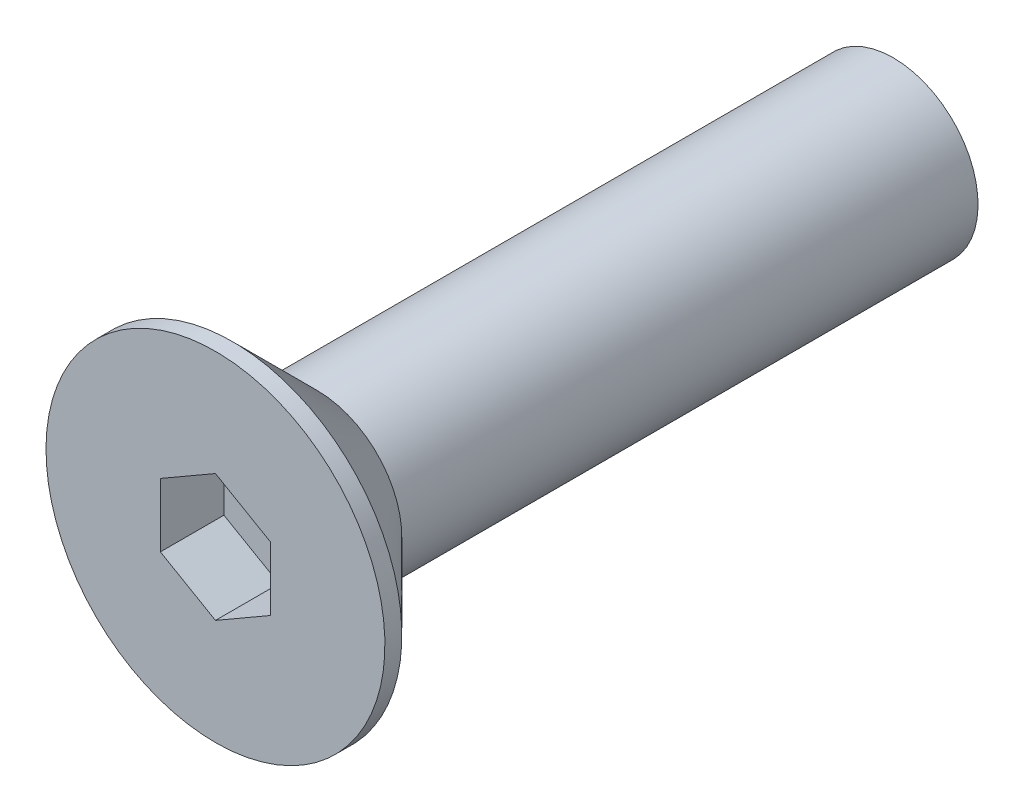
ISO-10303-21;
HEADER;
FILE_DESCRIPTION(('STEP AP214'),'2;1');
FILE_NAME('part.step','',(''),(''),'','','');
FILE_SCHEMA(('AUTOMOTIVE_DESIGN { 1 0 10303 214 1 1 1 1 }'));
ENDSEC;
DATA;
#1=APPLICATION_CONTEXT('core data for automotive mechanical design processes');
#2=APPLICATION_PROTOCOL_DEFINITION('international standard','automotive_design',2000,#1);
#3=PRODUCT_CONTEXT('',#1,'mechanical');
#4=PRODUCT('Part','Part','',(#3));
#5=PRODUCT_RELATED_PRODUCT_CATEGORY('part','',(#4));
#6=PRODUCT_DEFINITION_FORMATION('','',#4);
#7=PRODUCT_DEFINITION_CONTEXT('part definition',#1,'design');
#8=PRODUCT_DEFINITION('design','',#6,#7);
#9=PRODUCT_DEFINITION_SHAPE('','',#8);
#10=(LENGTH_UNIT() NAMED_UNIT(*) SI_UNIT(.MILLI.,.METRE.));
#11=(NAMED_UNIT(*) PLANE_ANGLE_UNIT() SI_UNIT($,.RADIAN.));
#12=(NAMED_UNIT(*) SI_UNIT($,.STERADIAN.) SOLID_ANGLE_UNIT());
#13=UNCERTAINTY_MEASURE_WITH_UNIT(LENGTH_MEASURE(1.E-05),#10,'distance_accuracy_value','');
#14=(GEOMETRIC_REPRESENTATION_CONTEXT(3) GLOBAL_UNCERTAINTY_ASSIGNED_CONTEXT((#13)) GLOBAL_UNIT_ASSIGNED_CONTEXT((#10,
#11,#12)) REPRESENTATION_CONTEXT('',''));
#15=CARTESIAN_POINT('',(0.,0.,0.));
#16=DIRECTION('',(0.,0.,1.));
#17=DIRECTION('',(1.,0.,0.));
#18=AXIS2_PLACEMENT_3D('',#15,#16,#17);
#19=CARTESIAN_POINT('',(1.73205080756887,1.,0.));
#20=DIRECTION('',(0.,0.,-1.));
#21=DIRECTION('',(0.866025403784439,0.5,0.));
#22=AXIS2_PLACEMENT_3D('',#19,#20,#21);
#23=PLANE('',#22);
#24=DIRECTION('',(0.866025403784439,-0.5,0.));
#25=VECTOR('',#24,1.);
#26=CARTESIAN_POINT('',(-0.65,-0.375277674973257,0.));
#27=LINE('',#26,#25);
#28=CARTESIAN_POINT('',(-0.65,-0.375277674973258,0.));
#29=VERTEX_POINT('',#28);
#30=CARTESIAN_POINT('',(0.,-0.750555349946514,0.));
#31=VERTEX_POINT('',#30);
#32=EDGE_CURVE('E102',#29,#31,#27,.T.);
#33=ORIENTED_EDGE('',*,*,#32,.F.);
#34=DIRECTION('',(0.,-1.,0.));
#35=VECTOR('',#34,1.);
#36=CARTESIAN_POINT('',(-0.65,0.375277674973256,0.));
#37=LINE('',#36,#35);
#38=CARTESIAN_POINT('',(-0.65,0.375277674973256,0.));
#39=VERTEX_POINT('',#38);
#40=EDGE_CURVE('E28',#39,#29,#37,.T.);
#41=ORIENTED_EDGE('',*,*,#40,.F.);
#42=DIRECTION('',(-0.866025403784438,-0.5,0.));
#43=VECTOR('',#42,1.);
#44=CARTESIAN_POINT('',(0.,0.750555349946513,0.));
#45=LINE('',#44,#43);
#46=CARTESIAN_POINT('',(0.,0.750555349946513,0.));
#47=VERTEX_POINT('',#46);
#48=EDGE_CURVE('E111',#47,#39,#45,.T.);
#49=ORIENTED_EDGE('',*,*,#48,.F.);
#50=DIRECTION('',(-0.866025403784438,0.5,0.));
#51=VECTOR('',#50,1.);
#52=CARTESIAN_POINT('',(0.65,0.375277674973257,0.));
#53=LINE('',#52,#51);
#54=CARTESIAN_POINT('',(0.65,0.375277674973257,0.));
#55=VERTEX_POINT('',#54);
#56=EDGE_CURVE('E109',#55,#47,#53,.T.);
#57=ORIENTED_EDGE('',*,*,#56,.F.);
#58=DIRECTION('',(0.,1.,0.));
#59=VECTOR('',#58,1.);
#60=CARTESIAN_POINT('',(0.65,-0.375277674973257,0.));
#61=LINE('',#60,#59);
#62=CARTESIAN_POINT('',(0.65,-0.375277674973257,0.));
#63=VERTEX_POINT('',#62);
#64=EDGE_CURVE('E76',#63,#55,#61,.T.);
#65=ORIENTED_EDGE('',*,*,#64,.F.);
#66=DIRECTION('',(0.866025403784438,0.5,0.));
#67=VECTOR('',#66,1.);
#68=CARTESIAN_POINT('',(0.,-0.750555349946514,0.));
#69=LINE('',#68,#67);
#70=EDGE_CURVE('E105',#31,#63,#69,.T.);
#71=ORIENTED_EDGE('',*,*,#70,.F.);
#72=EDGE_LOOP('',(#33,#41,#49,#57,#65,#71));
#73=FACE_BOUND('',#72,.T.);
#74=CARTESIAN_POINT('',(0.,0.,0.));
#75=DIRECTION('',(0.,0.,1.));
#76=DIRECTION('',(-0.866025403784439,-0.5,0.));
#77=AXIS2_PLACEMENT_3D('',#74,#75,#76);
#78=CIRCLE('',#77,2.);
#79=CARTESIAN_POINT('',(-1.73205080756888,-1.,0.));
#80=VERTEX_POINT('',#79);
#81=EDGE_CURVE('E115',#80,#80,#78,.T.);
#82=ORIENTED_EDGE('',*,*,#81,.T.);
#83=EDGE_LOOP('',(#82));
#84=FACE_BOUND('',#83,.T.);
#85=ADVANCED_FACE('F14',(#73,#84),#23,.F.);
#86=CARTESIAN_POINT('',(0.,0.,-8.));
#87=DIRECTION('',(0.,0.,1.));
#88=DIRECTION('',(-0.866025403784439,-0.5,0.));
#89=AXIS2_PLACEMENT_3D('',#86,#87,#88);
#90=PLANE('',#89);
#91=CARTESIAN_POINT('',(0.,0.,-8.));
#92=DIRECTION('',(0.,0.,1.));
#93=DIRECTION('',(-0.866025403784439,-0.5,0.));
#94=AXIS2_PLACEMENT_3D('',#91,#92,#93);
#95=CIRCLE('',#94,1.);
#96=CARTESIAN_POINT('',(-0.866025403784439,-0.5,-8.));
#97=VERTEX_POINT('',#96);
#98=EDGE_CURVE('E9',#97,#97,#95,.T.);
#99=ORIENTED_EDGE('',*,*,#98,.F.);
#100=EDGE_LOOP('',(#99));
#101=FACE_BOUND('',#100,.T.);
#102=ADVANCED_FACE('F133',(#101),#90,.F.);
#103=CARTESIAN_POINT('',(0.,0.,0.));
#104=DIRECTION('',(0.,0.,1.));
#105=DIRECTION('',(-0.866025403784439,-0.5,0.));
#106=AXIS2_PLACEMENT_3D('',#103,#104,#105);
#107=CYLINDRICAL_SURFACE('',#106,1.);
#108=CARTESIAN_POINT('',(0.,0.,-1.2));
#109=DIRECTION('',(0.,0.,1.));
#110=DIRECTION('',(-0.866025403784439,-0.5,0.));
#111=AXIS2_PLACEMENT_3D('',#108,#109,#110);
#112=CIRCLE('',#111,1.);
#113=CARTESIAN_POINT('',(-0.866025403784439,-0.5,-1.2));
#114=VERTEX_POINT('',#113);
#115=EDGE_CURVE('E21',#114,#114,#112,.T.);
#116=ORIENTED_EDGE('',*,*,#115,.F.);
#117=EDGE_LOOP('',(#116));
#118=FACE_BOUND('',#117,.T.);
#119=ORIENTED_EDGE('',*,*,#98,.T.);
#120=EDGE_LOOP('',(#119));
#121=FACE_BOUND('',#120,.T.);
#122=ADVANCED_FACE('F130',(#118,#121),#107,.T.);
#123=CARTESIAN_POINT('',(0.,0.,-1.2));
#124=DIRECTION('',(0.,0.,1.));
#125=DIRECTION('',(-0.866025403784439,-0.5,0.));
#126=AXIS2_PLACEMENT_3D('',#123,#124,#125);
#127=CONICAL_SURFACE('',#126,1.,0.785398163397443);
#128=CARTESIAN_POINT('',(0.,0.,-0.2));
#129=DIRECTION('',(0.,0.,1.));
#130=DIRECTION('',(-0.866025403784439,-0.5,0.));
#131=AXIS2_PLACEMENT_3D('',#128,#129,#130);
#132=CIRCLE('',#131,2.);
#133=CARTESIAN_POINT('',(-1.73205080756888,-1.,-0.2));
#134=VERTEX_POINT('',#133);
#135=EDGE_CURVE('E123',#134,#134,#132,.T.);
#136=ORIENTED_EDGE('',*,*,#135,.F.);
#137=EDGE_LOOP('',(#136));
#138=FACE_BOUND('',#137,.T.);
#139=ORIENTED_EDGE('',*,*,#115,.T.);
#140=EDGE_LOOP('',(#139));
#141=FACE_BOUND('',#140,.T.);
#142=ADVANCED_FACE('F128',(#138,#141),#127,.T.);
#143=CARTESIAN_POINT('',(0.,0.,0.));
#144=DIRECTION('',(0.,0.,1.));
#145=DIRECTION('',(-0.866025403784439,-0.5,0.));
#146=AXIS2_PLACEMENT_3D('',#143,#144,#145);
#147=CYLINDRICAL_SURFACE('',#146,2.);
#148=ORIENTED_EDGE('',*,*,#81,.F.);
#149=EDGE_LOOP('',(#148));
#150=FACE_BOUND('',#149,.T.);
#151=ORIENTED_EDGE('',*,*,#135,.T.);
#152=EDGE_LOOP('',(#151));
#153=FACE_BOUND('',#152,.T.);
#154=ADVANCED_FACE('F146',(#150,#153),#147,.T.);
#155=CARTESIAN_POINT('',(-0.65,0.375277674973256,-0.75));
#156=DIRECTION('',(-1.,0.,0.));
#157=DIRECTION('',(0.,1.,0.));
#158=AXIS2_PLACEMENT_3D('',#155,#156,#157);
#159=PLANE('',#158);
#160=ORIENTED_EDGE('',*,*,#40,.T.);
#161=DIRECTION('',(0.,0.,1.));
#162=VECTOR('',#161,1.);
#163=CARTESIAN_POINT('',(-0.65,-0.375277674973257,-0.75));
#164=LINE('',#163,#162);
#165=CARTESIAN_POINT('',(-0.65,-0.375277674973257,-0.75));
#166=VERTEX_POINT('',#165);
#167=EDGE_CURVE('E58',#166,#29,#164,.T.);
#168=ORIENTED_EDGE('',*,*,#167,.F.);
#169=DIRECTION('',(0.,-1.,0.));
#170=VECTOR('',#169,1.);
#171=CARTESIAN_POINT('',(-0.65,0.375277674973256,-0.75));
#172=LINE('',#171,#170);
#173=CARTESIAN_POINT('',(-0.65,0.375277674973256,-0.75));
#174=VERTEX_POINT('',#173);
#175=EDGE_CURVE('E113',#174,#166,#172,.T.);
#176=ORIENTED_EDGE('',*,*,#175,.F.);
#177=DIRECTION('',(0.,0.,1.));
#178=VECTOR('',#177,1.);
#179=CARTESIAN_POINT('',(-0.65,0.375277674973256,-0.75));
#180=LINE('',#179,#178);
#181=EDGE_CURVE('E36',#174,#39,#180,.T.);
#182=ORIENTED_EDGE('',*,*,#181,.T.);
#183=EDGE_LOOP('',(#160,#168,#176,#182));
#184=FACE_BOUND('',#183,.T.);
#185=ADVANCED_FACE('F150',(#184),#159,.F.);
#186=CARTESIAN_POINT('',(0.,0.750555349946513,-0.75));
#187=DIRECTION('',(-0.5,0.866025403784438,0.));
#188=DIRECTION('',(0.866025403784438,0.5,0.));
#189=AXIS2_PLACEMENT_3D('',#186,#187,#188);
#190=PLANE('',#189);
#191=ORIENTED_EDGE('',*,*,#48,.T.);
#192=ORIENTED_EDGE('',*,*,#181,.F.);
#193=DIRECTION('',(-0.866025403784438,-0.5,0.));
#194=VECTOR('',#193,1.);
#195=CARTESIAN_POINT('',(0.,0.750555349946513,-0.75));
#196=LINE('',#195,#194);
#197=CARTESIAN_POINT('',(0.,0.750555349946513,-0.75));
#198=VERTEX_POINT('',#197);
#199=EDGE_CURVE('E88',#198,#174,#196,.T.);
#200=ORIENTED_EDGE('',*,*,#199,.F.);
#201=DIRECTION('',(0.,0.,1.));
#202=VECTOR('',#201,1.);
#203=CARTESIAN_POINT('',(0.,0.750555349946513,-0.75));
#204=LINE('',#203,#202);
#205=EDGE_CURVE('E80',#198,#47,#204,.T.);
#206=ORIENTED_EDGE('',*,*,#205,.T.);
#207=EDGE_LOOP('',(#191,#192,#200,#206));
#208=FACE_BOUND('',#207,.T.);
#209=ADVANCED_FACE('F154',(#208),#190,.F.);
#210=CARTESIAN_POINT('',(0.65,0.375277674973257,-0.75));
#211=DIRECTION('',(0.5,0.866025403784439,0.));
#212=DIRECTION('',(0.866025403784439,-0.5,0.));
#213=AXIS2_PLACEMENT_3D('',#210,#211,#212);
#214=PLANE('',#213);
#215=ORIENTED_EDGE('',*,*,#56,.T.);
#216=ORIENTED_EDGE('',*,*,#205,.F.);
#217=DIRECTION('',(-0.866025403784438,0.5,0.));
#218=VECTOR('',#217,1.);
#219=CARTESIAN_POINT('',(0.65,0.375277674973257,-0.75));
#220=LINE('',#219,#218);
#221=CARTESIAN_POINT('',(0.65,0.375277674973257,-0.75));
#222=VERTEX_POINT('',#221);
#223=EDGE_CURVE('E84',#222,#198,#220,.T.);
#224=ORIENTED_EDGE('',*,*,#223,.F.);
#225=DIRECTION('',(0.,0.,1.));
#226=VECTOR('',#225,1.);
#227=CARTESIAN_POINT('',(0.65,0.375277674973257,-0.75));
#228=LINE('',#227,#226);
#229=EDGE_CURVE('E69',#222,#55,#228,.T.);
#230=ORIENTED_EDGE('',*,*,#229,.T.);
#231=EDGE_LOOP('',(#215,#216,#224,#230));
#232=FACE_BOUND('',#231,.T.);
#233=ADVANCED_FACE('F85',(#232),#214,.F.);
#234=CARTESIAN_POINT('',(0.65,-0.375277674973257,-0.75));
#235=DIRECTION('',(1.,0.,0.));
#236=DIRECTION('',(0.,-1.,0.));
#237=AXIS2_PLACEMENT_3D('',#234,#235,#236);
#238=PLANE('',#237);
#239=ORIENTED_EDGE('',*,*,#64,.T.);
#240=ORIENTED_EDGE('',*,*,#229,.F.);
#241=DIRECTION('',(0.,1.,0.));
#242=VECTOR('',#241,1.);
#243=CARTESIAN_POINT('',(0.65,-0.375277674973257,-0.75));
#244=LINE('',#243,#242);
#245=CARTESIAN_POINT('',(0.65,-0.375277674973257,-0.75));
#246=VERTEX_POINT('',#245);
#247=EDGE_CURVE('E73',#246,#222,#244,.T.);
#248=ORIENTED_EDGE('',*,*,#247,.F.);
#249=DIRECTION('',(0.,0.,1.));
#250=VECTOR('',#249,1.);
#251=CARTESIAN_POINT('',(0.65,-0.375277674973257,-0.75));
#252=LINE('',#251,#250);
#253=EDGE_CURVE('E81',#246,#63,#252,.T.);
#254=ORIENTED_EDGE('',*,*,#253,.T.);
#255=EDGE_LOOP('',(#239,#240,#248,#254));
#256=FACE_BOUND('',#255,.T.);
#257=ADVANCED_FACE('F71',(#256),#238,.F.);
#258=CARTESIAN_POINT('',(0.,-0.750555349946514,-0.75));
#259=DIRECTION('',(0.5,-0.866025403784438,0.));
#260=DIRECTION('',(-0.866025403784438,-0.5,0.));
#261=AXIS2_PLACEMENT_3D('',#258,#259,#260);
#262=PLANE('',#261);
#263=ORIENTED_EDGE('',*,*,#70,.T.);
#264=ORIENTED_EDGE('',*,*,#253,.F.);
#265=DIRECTION('',(0.866025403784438,0.5,0.));
#266=VECTOR('',#265,1.);
#267=CARTESIAN_POINT('',(0.,-0.750555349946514,-0.75));
#268=LINE('',#267,#266);
#269=CARTESIAN_POINT('',(0.,-0.750555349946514,-0.75));
#270=VERTEX_POINT('',#269);
#271=EDGE_CURVE('E94',#270,#246,#268,.T.);
#272=ORIENTED_EDGE('',*,*,#271,.F.);
#273=DIRECTION('',(0.,0.,1.));
#274=VECTOR('',#273,1.);
#275=CARTESIAN_POINT('',(0.,-0.750555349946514,-0.75));
#276=LINE('',#275,#274);
#277=EDGE_CURVE('E118',#270,#31,#276,.T.);
#278=ORIENTED_EDGE('',*,*,#277,.T.);
#279=EDGE_LOOP('',(#263,#264,#272,#278));
#280=FACE_BOUND('',#279,.T.);
#281=ADVANCED_FACE('F158',(#280),#262,.F.);
#282=CARTESIAN_POINT('',(-0.65,-0.375277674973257,-0.75));
#283=DIRECTION('',(-0.5,-0.866025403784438,0.));
#284=DIRECTION('',(-0.866025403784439,0.5,0.));
#285=AXIS2_PLACEMENT_3D('',#282,#283,#284);
#286=PLANE('',#285);
#287=ORIENTED_EDGE('',*,*,#32,.T.);
#288=ORIENTED_EDGE('',*,*,#277,.F.);
#289=DIRECTION('',(0.866025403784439,-0.5,0.));
#290=VECTOR('',#289,1.);
#291=CARTESIAN_POINT('',(-0.65,-0.375277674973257,-0.75));
#292=LINE('',#291,#290);
#293=EDGE_CURVE('E96',#166,#270,#292,.T.);
#294=ORIENTED_EDGE('',*,*,#293,.F.);
#295=ORIENTED_EDGE('',*,*,#167,.T.);
#296=EDGE_LOOP('',(#287,#288,#294,#295));
#297=FACE_BOUND('',#296,.T.);
#298=ADVANCED_FACE('F155',(#297),#286,.F.);
#299=CARTESIAN_POINT('',(0.,0.,-0.75));
#300=DIRECTION('',(0.,0.,1.));
#301=DIRECTION('',(0.5,-0.866025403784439,0.));
#302=AXIS2_PLACEMENT_3D('',#299,#300,#301);
#303=PLANE('',#302);
#304=ORIENTED_EDGE('',*,*,#175,.T.);
#305=ORIENTED_EDGE('',*,*,#293,.T.);
#306=ORIENTED_EDGE('',*,*,#271,.T.);
#307=ORIENTED_EDGE('',*,*,#247,.T.);
#308=ORIENTED_EDGE('',*,*,#223,.T.);
#309=ORIENTED_EDGE('',*,*,#199,.T.);
#310=EDGE_LOOP('',(#304,#305,#306,#307,#308,#309));
#311=FACE_BOUND('',#310,.T.);
#312=ADVANCED_FACE('F91',(#311),#303,.T.);
#313=CLOSED_SHELL('',(#85,#102,#122,#142,#154,#185,#209,#233,#257,#281,#298,#312));
#314=MANIFOLD_SOLID_BREP('B1',#313);
#315=ADVANCED_BREP_SHAPE_REPRESENTATION('',(#18,#314),#14);
#316=SHAPE_DEFINITION_REPRESENTATION(#9,#315);
ENDSEC;
END-ISO-10303-21;
